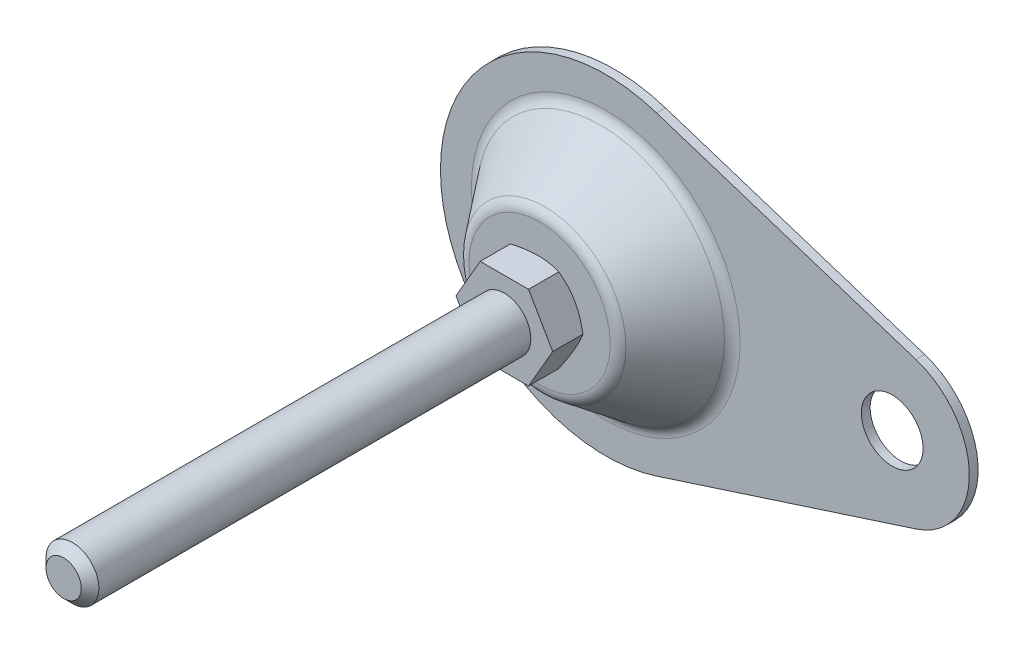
ISO-10303-21;
HEADER;
FILE_DESCRIPTION(('STEP AP214'),'2;1');
FILE_NAME('part.step','',(''),(''),'','','');
FILE_SCHEMA(('AUTOMOTIVE_DESIGN { 1 0 10303 214 1 1 1 1 }'));
ENDSEC;
DATA;
#1=APPLICATION_CONTEXT('core data for automotive mechanical design processes');
#2=APPLICATION_PROTOCOL_DEFINITION('international standard','automotive_design',2000,#1);
#3=PRODUCT_CONTEXT('',#1,'mechanical');
#4=PRODUCT('Part','Part','',(#3));
#5=PRODUCT_RELATED_PRODUCT_CATEGORY('part','',(#4));
#6=PRODUCT_DEFINITION_FORMATION('','',#4);
#7=PRODUCT_DEFINITION_CONTEXT('part definition',#1,'design');
#8=PRODUCT_DEFINITION('design','',#6,#7);
#9=PRODUCT_DEFINITION_SHAPE('','',#8);
#10=(LENGTH_UNIT() NAMED_UNIT(*) SI_UNIT(.MILLI.,.METRE.));
#11=(NAMED_UNIT(*) PLANE_ANGLE_UNIT() SI_UNIT($,.RADIAN.));
#12=(NAMED_UNIT(*) SI_UNIT($,.STERADIAN.) SOLID_ANGLE_UNIT());
#13=UNCERTAINTY_MEASURE_WITH_UNIT(LENGTH_MEASURE(1.E-05),#10,'distance_accuracy_value','');
#14=(GEOMETRIC_REPRESENTATION_CONTEXT(3) GLOBAL_UNCERTAINTY_ASSIGNED_CONTEXT((#13)) GLOBAL_UNIT_ASSIGNED_CONTEXT((#10,
#11,#12)) REPRESENTATION_CONTEXT('',''));
#15=CARTESIAN_POINT('',(0.,0.,0.));
#16=DIRECTION('',(0.,0.,1.));
#17=DIRECTION('',(1.,0.,0.));
#18=AXIS2_PLACEMENT_3D('',#15,#16,#17);
#19=CARTESIAN_POINT('',(65.,0.,2.));
#20=DIRECTION('',(0.,0.,1.));
#21=DIRECTION('',(1.,0.,0.));
#22=AXIS2_PLACEMENT_3D('',#19,#20,#21);
#23=PLANE('',#22);
#24=CARTESIAN_POINT('',(0.,0.,2.));
#25=DIRECTION('',(0.,0.,1.));
#26=DIRECTION('',(1.,0.,0.));
#27=AXIS2_PLACEMENT_3D('',#24,#25,#26);
#28=CIRCLE('',#27,30.4802116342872);
#29=CARTESIAN_POINT('',(30.4802116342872,0.,2.));
#30=VERTEX_POINT('',#29);
#31=EDGE_CURVE('E245',#30,#30,#28,.F.);
#32=ORIENTED_EDGE('',*,*,#31,.T.);
#33=EDGE_LOOP('',(#32));
#34=FACE_BOUND('',#33,.T.);
#35=CARTESIAN_POINT('',(65.,0.,2.));
#36=DIRECTION('',(0.,0.,1.));
#37=DIRECTION('',(1.,0.,0.));
#38=AXIS2_PLACEMENT_3D('',#35,#36,#37);
#39=CIRCLE('',#38,7.);
#40=CARTESIAN_POINT('',(72.,0.,2.));
#41=VERTEX_POINT('',#40);
#42=EDGE_CURVE('E262',#41,#41,#39,.T.);
#43=ORIENTED_EDGE('',*,*,#42,.F.);
#44=EDGE_LOOP('',(#43));
#45=FACE_BOUND('',#44,.T.);
#46=DIRECTION('',(-0.951485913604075,0.307692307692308,0.));
#47=VECTOR('',#46,1.);
#48=CARTESIAN_POINT('',(11.5384615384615,35.6807217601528,2.));
#49=LINE('',#48,#47);
#50=CARTESIAN_POINT('',(70.3846153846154,16.6510034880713,2.));
#51=VERTEX_POINT('',#50);
#52=CARTESIAN_POINT('',(11.5384615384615,35.6807217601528,2.));
#53=VERTEX_POINT('',#52);
#54=EDGE_CURVE('E112',#51,#53,#49,.T.);
#55=ORIENTED_EDGE('',*,*,#54,.T.);
#56=CARTESIAN_POINT('',(0.,0.,2.));
#57=DIRECTION('',(0.,0.,1.));
#58=DIRECTION('',(1.,0.,0.));
#59=AXIS2_PLACEMENT_3D('',#56,#57,#58);
#60=CIRCLE('',#59,37.5);
#61=CARTESIAN_POINT('',(11.5384615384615,-35.6807217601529,2.));
#62=VERTEX_POINT('',#61);
#63=EDGE_CURVE('E114',#53,#62,#60,.T.);
#64=ORIENTED_EDGE('',*,*,#63,.T.);
#65=DIRECTION('',(0.951485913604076,0.307692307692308,0.));
#66=VECTOR('',#65,1.);
#67=CARTESIAN_POINT('',(11.5384615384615,-35.6807217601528,2.));
#68=LINE('',#67,#66);
#69=CARTESIAN_POINT('',(70.3846153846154,-16.6510034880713,2.));
#70=VERTEX_POINT('',#69);
#71=EDGE_CURVE('E97',#62,#70,#68,.T.);
#72=ORIENTED_EDGE('',*,*,#71,.T.);
#73=CARTESIAN_POINT('',(65.,0.,2.));
#74=DIRECTION('',(0.,0.,1.));
#75=DIRECTION('',(1.,0.,0.));
#76=AXIS2_PLACEMENT_3D('',#73,#74,#75);
#77=CIRCLE('',#76,17.5);
#78=EDGE_CURVE('E106',#70,#51,#77,.T.);
#79=ORIENTED_EDGE('',*,*,#78,.T.);
#80=EDGE_LOOP('',(#55,#64,#72,#79));
#81=FACE_BOUND('',#80,.T.);
#82=ADVANCED_FACE('F14',(#34,#45,#81),#23,.T.);
#83=CARTESIAN_POINT('',(65.,0.,0.));
#84=DIRECTION('',(0.,0.,1.));
#85=DIRECTION('',(1.,0.,0.));
#86=AXIS2_PLACEMENT_3D('',#83,#84,#85);
#87=PLANE('',#86);
#88=CARTESIAN_POINT('',(65.,0.,0.));
#89=DIRECTION('',(0.,0.,1.));
#90=DIRECTION('',(1.,0.,0.));
#91=AXIS2_PLACEMENT_3D('',#88,#89,#90);
#92=CIRCLE('',#91,7.);
#93=CARTESIAN_POINT('',(72.,0.,0.));
#94=VERTEX_POINT('',#93);
#95=EDGE_CURVE('E258',#94,#94,#92,.T.);
#96=ORIENTED_EDGE('',*,*,#95,.T.);
#97=EDGE_LOOP('',(#96));
#98=FACE_BOUND('',#97,.T.);
#99=CARTESIAN_POINT('',(0.,0.,0.));
#100=DIRECTION('',(0.,0.,1.));
#101=DIRECTION('',(1.,0.,0.));
#102=AXIS2_PLACEMENT_3D('',#99,#100,#101);
#103=CIRCLE('',#102,37.5);
#104=CARTESIAN_POINT('',(11.5384615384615,35.6807217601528,0.));
#105=VERTEX_POINT('',#104);
#106=CARTESIAN_POINT('',(11.5384615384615,-35.6807217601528,0.));
#107=VERTEX_POINT('',#106);
#108=EDGE_CURVE('E275',#105,#107,#103,.T.);
#109=ORIENTED_EDGE('',*,*,#108,.F.);
#110=DIRECTION('',(-0.951485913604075,0.307692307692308,0.));
#111=VECTOR('',#110,1.);
#112=CARTESIAN_POINT('',(70.3846153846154,16.6510034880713,0.));
#113=LINE('',#112,#111);
#114=CARTESIAN_POINT('',(70.3846153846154,16.6510034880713,0.));
#115=VERTEX_POINT('',#114);
#116=EDGE_CURVE('E9',#115,#105,#113,.T.);
#117=ORIENTED_EDGE('',*,*,#116,.F.);
#118=CARTESIAN_POINT('',(65.,0.,0.));
#119=DIRECTION('',(0.,0.,1.));
#120=DIRECTION('',(1.,0.,0.));
#121=AXIS2_PLACEMENT_3D('',#118,#119,#120);
#122=CIRCLE('',#121,17.5);
#123=CARTESIAN_POINT('',(70.3846153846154,-16.6510034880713,0.));
#124=VERTEX_POINT('',#123);
#125=EDGE_CURVE('E22',#124,#115,#122,.T.);
#126=ORIENTED_EDGE('',*,*,#125,.F.);
#127=DIRECTION('',(0.951485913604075,0.307692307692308,0.));
#128=VECTOR('',#127,1.);
#129=CARTESIAN_POINT('',(70.3846153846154,-16.6510034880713,0.));
#130=LINE('',#129,#128);
#131=EDGE_CURVE('E99',#107,#124,#130,.T.);
#132=ORIENTED_EDGE('',*,*,#131,.F.);
#133=EDGE_LOOP('',(#109,#117,#126,#132));
#134=FACE_BOUND('',#133,.T.);
#135=ADVANCED_FACE('F215',(#98,#134),#87,.F.);
#136=CARTESIAN_POINT('',(0.,0.,17.));
#137=DIRECTION('',(0.,0.,-1.));
#138=DIRECTION('',(-1.,0.,0.));
#139=AXIS2_PLACEMENT_3D('',#136,#137,#138);
#140=PLANE('',#139);
#141=CARTESIAN_POINT('',(0.,0.,17.));
#142=DIRECTION('',(0.,0.,-1.));
#143=DIRECTION('',(-1.,0.,0.));
#144=AXIS2_PLACEMENT_3D('',#141,#142,#143);
#145=CIRCLE('',#144,16.0197883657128);
#146=CARTESIAN_POINT('',(-16.0197883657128,0.,17.));
#147=VERTEX_POINT('',#146);
#148=EDGE_CURVE('E278',#147,#147,#145,.F.);
#149=ORIENTED_EDGE('',*,*,#148,.T.);
#150=EDGE_LOOP('',(#149));
#151=FACE_BOUND('',#150,.T.);
#152=CARTESIAN_POINT('',(0.,0.,17.));
#153=DIRECTION('',(0.,0.,-1.));
#154=DIRECTION('',(-1.,0.,0.));
#155=AXIS2_PLACEMENT_3D('',#152,#153,#154);
#156=CIRCLE('',#155,9.);
#157=CARTESIAN_POINT('',(-9.,0.,17.));
#158=VERTEX_POINT('',#157);
#159=EDGE_CURVE('E122',#158,#158,#156,.T.);
#160=ORIENTED_EDGE('',*,*,#159,.T.);
#161=EDGE_LOOP('',(#160));
#162=FACE_BOUND('',#161,.T.);
#163=ADVANCED_FACE('F211',(#151,#162),#140,.F.);
#164=CARTESIAN_POINT('',(0.,0.,5.));
#165=DIRECTION('',(0.,0.,1.));
#166=DIRECTION('',(1.,0.,0.));
#167=AXIS2_PLACEMENT_3D('',#164,#165,#166);
#168=TOROIDAL_SURFACE('',#167,30.4802116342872,3.);
#169=CARTESIAN_POINT('',(0.,0.,3.1747053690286));
#170=DIRECTION('',(0.,0.,1.));
#171=DIRECTION('',(1.,0.,0.));
#172=AXIS2_PLACEMENT_3D('',#169,#170,#171);
#173=CIRCLE('',#172,28.0993925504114);
#174=CARTESIAN_POINT('',(28.0993925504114,0.,3.1747053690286));
#175=VERTEX_POINT('',#174);
#176=EDGE_CURVE('E242',#175,#175,#173,.T.);
#177=ORIENTED_EDGE('',*,*,#176,.F.);
#178=EDGE_LOOP('',(#177));
#179=FACE_BOUND('',#178,.T.);
#180=ORIENTED_EDGE('',*,*,#31,.F.);
#181=EDGE_LOOP('',(#180));
#182=FACE_BOUND('',#181,.T.);
#183=ADVANCED_FACE('F214',(#179,#182),#168,.F.);
#184=CARTESIAN_POINT('',(0.,0.,14.));
#185=DIRECTION('',(0.,0.,-1.));
#186=DIRECTION('',(-1.,0.,0.));
#187=AXIS2_PLACEMENT_3D('',#184,#185,#186);
#188=TOROIDAL_SURFACE('',#187,16.0197883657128,3.);
#189=ORIENTED_EDGE('',*,*,#148,.F.);
#190=EDGE_LOOP('',(#189));
#191=FACE_BOUND('',#190,.T.);
#192=CARTESIAN_POINT('',(0.,0.,15.8252946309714));
#193=DIRECTION('',(0.,0.,1.));
#194=DIRECTION('',(1.,0.,0.));
#195=AXIS2_PLACEMENT_3D('',#192,#193,#194);
#196=CIRCLE('',#195,18.4006074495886);
#197=CARTESIAN_POINT('',(18.4006074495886,0.,15.8252946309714));
#198=VERTEX_POINT('',#197);
#199=EDGE_CURVE('E251',#198,#198,#196,.F.);
#200=ORIENTED_EDGE('',*,*,#199,.F.);
#201=EDGE_LOOP('',(#200));
#202=FACE_BOUND('',#201,.T.);
#203=ADVANCED_FACE('F229',(#191,#202),#188,.T.);
#204=CARTESIAN_POINT('',(0.,0.,2.));
#205=DIRECTION('',(0.,0.,-1.));
#206=DIRECTION('',(-1.,0.,0.));
#207=AXIS2_PLACEMENT_3D('',#204,#205,#206);
#208=CYLINDRICAL_SURFACE('',#207,37.5);
#209=ORIENTED_EDGE('',*,*,#108,.T.);
#210=DIRECTION('',(0.,0.,1.));
#211=VECTOR('',#210,1.);
#212=CARTESIAN_POINT('',(11.5384615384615,-35.6807217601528,-8.));
#213=LINE('',#212,#211);
#214=EDGE_CURVE('E103',#107,#62,#213,.T.);
#215=ORIENTED_EDGE('',*,*,#214,.T.);
#216=ORIENTED_EDGE('',*,*,#63,.F.);
#217=DIRECTION('',(0.,0.,1.));
#218=VECTOR('',#217,1.);
#219=CARTESIAN_POINT('',(11.5384615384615,35.6807217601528,-8.));
#220=LINE('',#219,#218);
#221=EDGE_CURVE('E119',#105,#53,#220,.T.);
#222=ORIENTED_EDGE('',*,*,#221,.F.);
#223=EDGE_LOOP('',(#209,#215,#216,#222));
#224=FACE_BOUND('',#223,.T.);
#225=ADVANCED_FACE('F219',(#224),#208,.T.);
#226=CARTESIAN_POINT('',(65.,0.,2.));
#227=DIRECTION('',(0.,0.,-1.));
#228=DIRECTION('',(-1.,0.,0.));
#229=AXIS2_PLACEMENT_3D('',#226,#227,#228);
#230=CYLINDRICAL_SURFACE('',#229,7.);
#231=ORIENTED_EDGE('',*,*,#42,.T.);
#232=EDGE_LOOP('',(#231));
#233=FACE_BOUND('',#232,.T.);
#234=ORIENTED_EDGE('',*,*,#95,.F.);
#235=EDGE_LOOP('',(#234));
#236=FACE_BOUND('',#235,.T.);
#237=ADVANCED_FACE('F209',(#233,#236),#230,.F.);
#238=CARTESIAN_POINT('',(0.,0.,2.));
#239=DIRECTION('',(0.,0.,-1.));
#240=DIRECTION('',(-1.,0.,0.));
#241=AXIS2_PLACEMENT_3D('',#238,#239,#240);
#242=CONICAL_SURFACE('',#241,29.,0.654082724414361);
#243=ORIENTED_EDGE('',*,*,#176,.T.);
#244=EDGE_LOOP('',(#243));
#245=FACE_BOUND('',#244,.T.);
#246=ORIENTED_EDGE('',*,*,#199,.T.);
#247=EDGE_LOOP('',(#246));
#248=FACE_BOUND('',#247,.T.);
#249=ADVANCED_FACE('F151',(#245,#248),#242,.T.);
#250=CARTESIAN_POINT('',(0.,0.,17.));
#251=DIRECTION('',(0.,0.,1.));
#252=DIRECTION('',(1.,0.,0.));
#253=AXIS2_PLACEMENT_3D('',#250,#251,#252);
#254=CONICAL_SURFACE('',#253,9.,1.0471975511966);
#255=ORIENTED_EDGE('',*,*,#159,.F.);
#256=EDGE_LOOP('',(#255));
#257=FACE_BOUND('',#256,.T.);
#258=CARTESIAN_POINT('',(10.9697705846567,0.0002,18.137247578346));
#259=CARTESIAN_POINT('',(10.8492020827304,-0.208630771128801,18.0676485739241));
#260=CARTESIAN_POINT('',(10.7281840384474,-0.41824017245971,18.0012084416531));
#261=CARTESIAN_POINT('',(10.4851774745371,-0.839139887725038,17.8755224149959));
#262=CARTESIAN_POINT('',(10.3631886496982,-1.05043073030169,17.8162788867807));
#263=CARTESIAN_POINT('',(9.99525656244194,-1.68770779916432,17.6504897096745));
#264=CARTESIAN_POINT('',(9.74786083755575,-2.11620976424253,17.5561895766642));
#265=CARTESIAN_POINT('',(9.37764446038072,-2.75744333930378,17.4456138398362));
#266=CARTESIAN_POINT('',(9.2559298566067,-2.96825921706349,17.4141149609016));
#267=CARTESIAN_POINT('',(9.01193711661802,-3.39086703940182,17.3612933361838));
#268=CARTESIAN_POINT('',(8.88965896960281,-3.60265900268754,17.3399707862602));
#269=CARTESIAN_POINT('',(8.64489870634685,-4.02659621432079,17.3080481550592));
#270=CARTESIAN_POINT('',(8.52241700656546,-4.23874074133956,17.2974353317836));
#271=CARTESIAN_POINT('',(8.27734047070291,-4.66322575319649,17.2871576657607));
#272=CARTESIAN_POINT('',(8.15474563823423,-4.87556623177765,17.2874924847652));
#273=CARTESIAN_POINT('',(7.92555157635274,-5.27254199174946,17.2983485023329));
#274=CARTESIAN_POINT('',(7.81893617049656,-5.45720529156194,17.3075454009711));
#275=CARTESIAN_POINT('',(7.60595470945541,-5.82610000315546,17.3340405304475));
#276=CARTESIAN_POINT('',(7.49958867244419,-6.01033138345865,17.3513393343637));
#277=CARTESIAN_POINT('',(7.18090270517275,-6.56231167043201,17.414979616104));
#278=CARTESIAN_POINT('',(6.96914687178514,-6.92908353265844,17.4730570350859));
#279=CARTESIAN_POINT('',(6.5433889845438,-7.66651782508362,17.6182511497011));
#280=CARTESIAN_POINT('',(6.32944126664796,-8.03708614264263,17.7059833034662));
#281=CARTESIAN_POINT('',(5.90473630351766,-8.77269671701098,17.9050988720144));
#282=CARTESIAN_POINT('',(5.69397361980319,-9.137748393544,18.0164355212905));
#283=CARTESIAN_POINT('',(5.48471208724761,-9.5002,18.137247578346));
#284=B_SPLINE_CURVE_WITH_KNOTS('',3,(#258,#259,#260,#261,#262,#263,#264,#265,#266,#267,#268,
#269,#270,#271,#272,#273,#274,#275,#276,#277,#278,#279,#280,#281,#282,#283),.UNSPECIFIED.,.F.,
.F.,(4,2,2,2,2,2,2,2,2,2,2,2,4),(0.,0.752880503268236,1.50600787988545,3.0154687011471,
3.75167336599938,4.48789219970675,5.22323407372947,5.95855322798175,6.59868084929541,
7.23885375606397,8.52010929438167,9.82978009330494,11.1368800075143),.UNSPECIFIED.);
#285=CARTESIAN_POINT('',(10.9696551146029,0.,18.1371809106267));
#286=VERTEX_POINT('',#285);
#287=CARTESIAN_POINT('',(5.48482755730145,-9.5,18.1371809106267));
#288=VERTEX_POINT('',#287);
#289=EDGE_CURVE('E29',#286,#288,#284,.T.);
#290=ORIENTED_EDGE('',*,*,#289,.T.);
#291=CARTESIAN_POINT('',(-14.7429583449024,-9.5,21.9298013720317));
#292=CARTESIAN_POINT('',(-14.5354225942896,-9.5,21.8290822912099));
#293=CARTESIAN_POINT('',(-14.3276435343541,-9.5,21.7288647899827));
#294=CARTESIAN_POINT('',(-13.9115480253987,-9.5,21.5295465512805));
#295=CARTESIAN_POINT('',(-13.7032315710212,-9.5,21.4304458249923));
#296=CARTESIAN_POINT('',(-13.0773445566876,-9.5,21.1349631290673));
#297=CARTESIAN_POINT('',(-12.6588976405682,-9.5,20.9404304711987));
#298=CARTESIAN_POINT('',(-11.8169345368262,-9.5,20.5564267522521));
#299=CARTESIAN_POINT('',(-11.3934031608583,-9.5,20.3669889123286));
#300=CARTESIAN_POINT('',(-10.5429751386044,-9.5,19.9958516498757));
#301=CARTESIAN_POINT('',(-10.116078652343,-9.5,19.8141518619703));
#302=CARTESIAN_POINT('',(-9.24457729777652,-9.5,19.4549066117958));
#303=CARTESIAN_POINT('',(-8.79984130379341,-9.5,19.2776775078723));
#304=CARTESIAN_POINT('',(-7.90517155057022,-9.5,18.9366081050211));
#305=CARTESIAN_POINT('',(-7.45523721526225,-9.5,18.7727693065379));
#306=CARTESIAN_POINT('',(-6.55028756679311,-9.5,18.4627738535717));
#307=CARTESIAN_POINT('',(-6.09528460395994,-9.5,18.3165815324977));
#308=CARTESIAN_POINT('',(-5.17876919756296,-9.5,18.0465606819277));
#309=CARTESIAN_POINT('',(-4.71725884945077,-9.5,17.9227251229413));
#310=CARTESIAN_POINT('',(-3.78987247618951,-9.5,17.7040004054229));
#311=CARTESIAN_POINT('',(-3.32403341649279,-9.5,17.6089587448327));
#312=CARTESIAN_POINT('',(-2.62102556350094,-9.5,17.4921194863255));
#313=CARTESIAN_POINT('',(-2.38596467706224,-9.5,17.457458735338));
#314=CARTESIAN_POINT('',(-1.91467110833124,-9.5,17.3973911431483));
#315=CARTESIAN_POINT('',(-1.67843854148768,-9.5,17.3719834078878));
#316=CARTESIAN_POINT('',(-1.20821079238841,-9.5,17.3312474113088));
#317=CARTESIAN_POINT('',(-0.974226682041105,-9.5,17.3157918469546));
#318=CARTESIAN_POINT('',(-0.505814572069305,-9.5,17.294789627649));
#319=CARTESIAN_POINT('',(-0.271386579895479,-9.5,17.2892428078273));
#320=CARTESIAN_POINT('',(0.197496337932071,-9.5,17.2881904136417));
#321=CARTESIAN_POINT('',(0.431951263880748,-9.5,17.2926849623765));
#322=CARTESIAN_POINT('',(0.900462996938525,-9.5,17.3116055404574));
#323=CARTESIAN_POINT('',(1.13451978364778,-9.5,17.3260320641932));
#324=CARTESIAN_POINT('',(1.69659323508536,-9.5,17.372296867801));
#325=CARTESIAN_POINT('',(2.02423218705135,-9.5,17.4088230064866));
#326=CARTESIAN_POINT('',(2.67707070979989,-9.5,17.4993477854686));
#327=CARTESIAN_POINT('',(3.00226994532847,-9.5,17.5533487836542));
#328=CARTESIAN_POINT('',(3.97382957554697,-9.5,17.738699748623));
#329=CARTESIAN_POINT('',(4.61580035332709,-9.5,17.8933649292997));
#330=CARTESIAN_POINT('',(5.5759947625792,-9.5,18.1615399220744));
#331=CARTESIAN_POINT('',(5.89919518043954,-9.5,18.2582537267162));
#332=CARTESIAN_POINT('',(6.54245535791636,-9.5,18.4617088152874));
#333=CARTESIAN_POINT('',(6.86251509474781,-9.5,18.5684501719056));
#334=CARTESIAN_POINT('',(7.49959853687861,-9.5,18.7902486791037));
#335=CARTESIAN_POINT('',(7.81662318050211,-9.5,18.9053031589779));
#336=CARTESIAN_POINT('',(8.44804318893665,-9.5,19.1423755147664));
#337=CARTESIAN_POINT('',(8.76243860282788,-9.5,19.2643932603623));
#338=CARTESIAN_POINT('',(9.5756719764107,-9.5,19.5887146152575));
#339=CARTESIAN_POINT('',(10.0727160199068,-9.5,19.7955110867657));
#340=CARTESIAN_POINT('',(11.0620207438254,-9.5,20.2202826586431));
#341=CARTESIAN_POINT('',(11.5542809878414,-9.5,20.4382587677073));
#342=CARTESIAN_POINT('',(12.5350566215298,-9.5,20.882860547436));
#343=CARTESIAN_POINT('',(13.0235707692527,-9.5,21.1094889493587));
#344=CARTESIAN_POINT('',(13.9974170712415,-9.5,21.569421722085));
#345=CARTESIAN_POINT('',(14.4827493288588,-9.5,21.8027258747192));
#346=CARTESIAN_POINT('',(15.4515102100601,-9.5,22.2749464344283));
#347=CARTESIAN_POINT('',(15.9349352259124,-9.5,22.513870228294));
#348=CARTESIAN_POINT('',(16.899664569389,-9.5,22.9959629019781));
#349=CARTESIAN_POINT('',(17.3809688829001,-9.5,23.2391318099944));
#350=CARTESIAN_POINT('',(18.3417325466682,-9.5,23.7288672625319));
#351=CARTESIAN_POINT('',(18.8211922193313,-9.5,23.9754331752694));
#352=CARTESIAN_POINT('',(19.7786465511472,-9.5,24.4713947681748));
#353=CARTESIAN_POINT('',(20.2566412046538,-9.5,24.7207904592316));
#354=CARTESIAN_POINT('',(21.5947430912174,-9.5,25.4231216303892));
#355=CARTESIAN_POINT('',(22.4534701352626,-9.5,25.8786862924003));
#356=CARTESIAN_POINT('',(24.1679995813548,-9.5,26.7953779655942));
#357=CARTESIAN_POINT('',(25.0238018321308,-9.5,27.2565052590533));
#358=CARTESIAN_POINT('',(26.7305921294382,-9.5,28.1815595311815));
#359=CARTESIAN_POINT('',(27.5815869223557,-9.5,28.6454740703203));
#360=CARTESIAN_POINT('',(28.8567319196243,-9.5,29.3437348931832));
#361=CARTESIAN_POINT('',(29.2815414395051,-9.5,29.5768787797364));
#362=CARTESIAN_POINT('',(30.1307670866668,-9.5,30.0438806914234));
#363=CARTESIAN_POINT('',(30.5551832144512,-9.5,30.2777387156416));
#364=CARTESIAN_POINT('',(30.9794262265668,-9.5,30.5119104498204));
#365=B_SPLINE_CURVE_WITH_KNOTS('',3,(#291,#292,#293,#294,#295,#296,#297,#298,#299,#300,#301,
#302,#303,#304,#305,#306,#307,#308,#309,#310,#311,#312,#313,#314,#315,#316,#317,#318,#319,#320,
#321,#322,#323,#324,#325,#326,#327,#328,#329,#330,#331,#332,#333,#334,#335,#336,#337,#338,#339,
#340,#341,#342,#343,#344,#345,#346,#347,#348,#349,#350,#351,#352,#353,#354,#355,#356,#357,#358,
#359,#360,#361,#362,#363,#364),.UNSPECIFIED.,.F.,.F.,(4,2,2,2,2,2,2,2,2,2,2,2,2,2,2,2,2,2,2,2,2,
2,2,2,2,2,2,2,2,2,2,2,2,2,2,2,4),(0.,0.692052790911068,1.38411250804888,2.76843643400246,
4.16027741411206,5.55205260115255,6.98813128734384,8.42437067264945,9.85765675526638,
11.2904913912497,12.7155989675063,13.4282532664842,14.1408386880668,14.8441178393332,
15.5473852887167,16.2506613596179,16.9539724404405,17.9424205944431,18.9310021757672,
20.9092197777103,21.9212165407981,22.933220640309,23.9449010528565,24.9565625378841,
26.5714048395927,28.1863930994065,29.8018954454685,31.4173450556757,33.035052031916,
34.6527697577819,36.2701905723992,37.8876176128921,40.8038441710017,43.7202193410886,
46.6279029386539,48.0816468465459,49.5353888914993),.UNSPECIFIED.);
#366=CARTESIAN_POINT('',(-5.48482755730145,-9.5,18.1371809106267));
#367=VERTEX_POINT('',#366);
#368=EDGE_CURVE('E158',#288,#367,#365,.F.);
#369=ORIENTED_EDGE('',*,*,#368,.T.);
#370=CARTESIAN_POINT('',(-5.48471208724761,-9.5002,18.137247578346));
#371=CARTESIAN_POINT('',(-5.6052805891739,-9.2913692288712,18.0676485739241));
#372=CARTESIAN_POINT('',(-5.72629863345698,-9.0817598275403,18.0012084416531));
#373=CARTESIAN_POINT('',(-5.96930519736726,-8.66086011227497,17.8755224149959));
#374=CARTESIAN_POINT('',(-6.09129402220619,-8.44956926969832,17.8162788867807));
#375=CARTESIAN_POINT('',(-6.4592261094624,-7.81229220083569,17.6504897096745));
#376=CARTESIAN_POINT('',(-6.70662183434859,-7.38379023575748,17.5561895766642));
#377=CARTESIAN_POINT('',(-7.07683821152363,-6.74255666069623,17.4456138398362));
#378=CARTESIAN_POINT('',(-7.19855281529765,-6.53174078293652,17.4141149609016));
#379=CARTESIAN_POINT('',(-7.44254555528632,-6.10913296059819,17.3612933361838));
#380=CARTESIAN_POINT('',(-7.56482370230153,-5.89734099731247,17.3399707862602));
#381=CARTESIAN_POINT('',(-7.80958396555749,-5.47340378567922,17.3080481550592));
#382=CARTESIAN_POINT('',(-7.93206566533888,-5.26125925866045,17.2974353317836));
#383=CARTESIAN_POINT('',(-8.17714220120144,-4.83677424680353,17.2871576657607));
#384=CARTESIAN_POINT('',(-8.29973703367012,-4.62443376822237,17.2874924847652));
#385=CARTESIAN_POINT('',(-8.52893109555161,-4.22745800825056,17.2983485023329));
#386=CARTESIAN_POINT('',(-8.63554650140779,-4.04279470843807,17.3075454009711));
#387=CARTESIAN_POINT('',(-8.84852796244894,-3.67389999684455,17.3340405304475));
#388=CARTESIAN_POINT('',(-8.95489399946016,-3.48966861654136,17.3513393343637));
#389=CARTESIAN_POINT('',(-9.27357996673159,-2.937688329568,17.414979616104));
#390=CARTESIAN_POINT('',(-9.48533580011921,-2.57091646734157,17.473057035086));
#391=CARTESIAN_POINT('',(-9.91109368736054,-1.83348217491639,17.6182511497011));
#392=CARTESIAN_POINT('',(-10.1250414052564,-1.46291385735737,17.7059833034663));
#393=CARTESIAN_POINT('',(-10.5497463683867,-0.727303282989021,17.9050988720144));
#394=CARTESIAN_POINT('',(-10.7605090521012,-0.362251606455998,18.0164355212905));
#395=CARTESIAN_POINT('',(-10.9697705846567,0.00019999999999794,18.137247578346));
#396=B_SPLINE_CURVE_WITH_KNOTS('',3,(#370,#371,#372,#373,#374,#375,#376,#377,#378,#379,#380,
#381,#382,#383,#384,#385,#386,#387,#388,#389,#390,#391,#392,#393,#394,#395),.UNSPECIFIED.,.F.,
.F.,(4,2,2,2,2,2,2,2,2,2,2,2,4),(0.,0.752880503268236,1.50600787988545,3.0154687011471,
3.75167336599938,4.48789219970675,5.22323407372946,5.95855322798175,6.59868084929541,
7.23885375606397,8.52010929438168,9.82978009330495,11.1368800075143),.UNSPECIFIED.);
#397=CARTESIAN_POINT('',(-10.9696551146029,0.,18.1371809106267));
#398=VERTEX_POINT('',#397);
#399=EDGE_CURVE('E127',#367,#398,#396,.T.);
#400=ORIENTED_EDGE('',*,*,#399,.T.);
#401=CARTESIAN_POINT('',(-10.9697705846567,-0.000200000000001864,18.137247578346));
#402=CARTESIAN_POINT('',(-10.8492020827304,0.208630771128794,18.0676485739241));
#403=CARTESIAN_POINT('',(-10.7281840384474,0.418240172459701,18.0012084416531));
#404=CARTESIAN_POINT('',(-10.4851774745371,0.839139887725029,17.8755224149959));
#405=CARTESIAN_POINT('',(-10.3631886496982,1.05043073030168,17.8162788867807));
#406=CARTESIAN_POINT('',(-9.99525656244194,1.68770779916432,17.6504897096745));
#407=CARTESIAN_POINT('',(-9.74786083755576,2.11620976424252,17.5561895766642));
#408=CARTESIAN_POINT('',(-9.37764446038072,2.75744333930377,17.4456138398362));
#409=CARTESIAN_POINT('',(-9.2559298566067,2.96825921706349,17.4141149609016));
#410=CARTESIAN_POINT('',(-9.01193711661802,3.39086703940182,17.3612933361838));
#411=CARTESIAN_POINT('',(-8.88965896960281,3.60265900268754,17.3399707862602));
#412=CARTESIAN_POINT('',(-8.64489870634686,4.02659621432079,17.3080481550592));
#413=CARTESIAN_POINT('',(-8.52241700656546,4.23874074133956,17.2974353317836));
#414=CARTESIAN_POINT('',(-8.27734047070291,4.66322575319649,17.2871576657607));
#415=CARTESIAN_POINT('',(-8.15474563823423,4.87556623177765,17.2874924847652));
#416=CARTESIAN_POINT('',(-7.92555157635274,5.27254199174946,17.2983485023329));
#417=CARTESIAN_POINT('',(-7.81893617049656,5.45720529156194,17.3075454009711));
#418=CARTESIAN_POINT('',(-7.60595470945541,5.82610000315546,17.3340405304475));
#419=CARTESIAN_POINT('',(-7.49958867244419,6.01033138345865,17.3513393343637));
#420=CARTESIAN_POINT('',(-7.18090270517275,6.56231167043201,17.414979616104));
#421=CARTESIAN_POINT('',(-6.96914687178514,6.92908353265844,17.4730570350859));
#422=CARTESIAN_POINT('',(-6.5433889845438,7.66651782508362,17.6182511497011));
#423=CARTESIAN_POINT('',(-6.32944126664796,8.03708614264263,17.7059833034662));
#424=CARTESIAN_POINT('',(-5.90473630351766,8.77269671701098,17.9050988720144));
#425=CARTESIAN_POINT('',(-5.69397361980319,9.137748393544,18.0164355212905));
#426=CARTESIAN_POINT('',(-5.48471208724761,9.5002,18.137247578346));
#427=B_SPLINE_CURVE_WITH_KNOTS('',3,(#401,#402,#403,#404,#405,#406,#407,#408,#409,#410,#411,
#412,#413,#414,#415,#416,#417,#418,#419,#420,#421,#422,#423,#424,#425,#426),.UNSPECIFIED.,.F.,
.F.,(4,2,2,2,2,2,2,2,2,2,2,2,4),(0.,0.752880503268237,1.50600787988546,3.01546870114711,
3.75167336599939,4.48789219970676,5.22323407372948,5.95855322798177,6.59868084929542,
7.23885375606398,8.52010929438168,9.82978009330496,11.1368800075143),.UNSPECIFIED.);
#428=CARTESIAN_POINT('',(-5.48482755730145,9.5,18.1371809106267));
#429=VERTEX_POINT('',#428);
#430=EDGE_CURVE('E135',#398,#429,#427,.T.);
#431=ORIENTED_EDGE('',*,*,#430,.T.);
#432=CARTESIAN_POINT('',(-14.7429583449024,9.5,21.9298013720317));
#433=CARTESIAN_POINT('',(-14.5354225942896,9.5,21.8290822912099));
#434=CARTESIAN_POINT('',(-14.3276435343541,9.5,21.7288647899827));
#435=CARTESIAN_POINT('',(-13.9115480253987,9.5,21.5295465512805));
#436=CARTESIAN_POINT('',(-13.7032315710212,9.5,21.4304458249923));
#437=CARTESIAN_POINT('',(-13.0773445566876,9.5,21.1349631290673));
#438=CARTESIAN_POINT('',(-12.6588976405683,9.5,20.9404304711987));
#439=CARTESIAN_POINT('',(-11.8169345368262,9.5,20.5564267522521));
#440=CARTESIAN_POINT('',(-11.3934031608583,9.5,20.3669889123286));
#441=CARTESIAN_POINT('',(-10.5429751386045,9.5,19.9958516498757));
#442=CARTESIAN_POINT('',(-10.116078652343,9.5,19.8141518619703));
#443=CARTESIAN_POINT('',(-9.24457729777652,9.5,19.4549066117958));
#444=CARTESIAN_POINT('',(-8.79984130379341,9.5,19.2776775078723));
#445=CARTESIAN_POINT('',(-7.90517155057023,9.5,18.9366081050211));
#446=CARTESIAN_POINT('',(-7.45523721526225,9.5,18.7727693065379));
#447=CARTESIAN_POINT('',(-6.55028756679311,9.5,18.4627738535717));
#448=CARTESIAN_POINT('',(-6.09528460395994,9.5,18.3165815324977));
#449=CARTESIAN_POINT('',(-5.17876919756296,9.5,18.0465606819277));
#450=CARTESIAN_POINT('',(-4.71725884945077,9.5,17.9227251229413));
#451=CARTESIAN_POINT('',(-3.78987247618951,9.5,17.7040004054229));
#452=CARTESIAN_POINT('',(-3.32403341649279,9.5,17.6089587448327));
#453=CARTESIAN_POINT('',(-2.62102556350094,9.5,17.4921194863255));
#454=CARTESIAN_POINT('',(-2.38596467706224,9.5,17.457458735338));
#455=CARTESIAN_POINT('',(-1.91467110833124,9.5,17.3973911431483));
#456=CARTESIAN_POINT('',(-1.67843854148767,9.5,17.3719834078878));
#457=CARTESIAN_POINT('',(-1.20821079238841,9.5,17.3312474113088));
#458=CARTESIAN_POINT('',(-0.974226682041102,9.5,17.3157918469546));
#459=CARTESIAN_POINT('',(-0.505814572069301,9.5,17.294789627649));
#460=CARTESIAN_POINT('',(-0.271386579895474,9.5,17.2892428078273));
#461=CARTESIAN_POINT('',(0.197496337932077,9.5,17.2881904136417));
#462=CARTESIAN_POINT('',(0.431951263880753,9.5,17.2926849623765));
#463=CARTESIAN_POINT('',(0.90046299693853,9.5,17.3116055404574));
#464=CARTESIAN_POINT('',(1.13451978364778,9.5,17.3260320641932));
#465=CARTESIAN_POINT('',(1.69659323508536,9.5,17.372296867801));
#466=CARTESIAN_POINT('',(2.02423218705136,9.5,17.4088230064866));
#467=CARTESIAN_POINT('',(2.6770707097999,9.5,17.4993477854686));
#468=CARTESIAN_POINT('',(3.00226994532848,9.5,17.5533487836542));
#469=CARTESIAN_POINT('',(3.97382957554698,9.5,17.738699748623));
#470=CARTESIAN_POINT('',(4.61580035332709,9.5,17.8933649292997));
#471=CARTESIAN_POINT('',(5.57599476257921,9.5,18.1615399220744));
#472=CARTESIAN_POINT('',(5.89919518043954,9.5,18.2582537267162));
#473=CARTESIAN_POINT('',(6.54245535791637,9.5,18.4617088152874));
#474=CARTESIAN_POINT('',(6.86251509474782,9.5,18.5684501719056));
#475=CARTESIAN_POINT('',(7.49959853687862,9.5,18.7902486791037));
#476=CARTESIAN_POINT('',(7.81662318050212,9.5,18.9053031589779));
#477=CARTESIAN_POINT('',(8.44804318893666,9.5,19.1423755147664));
#478=CARTESIAN_POINT('',(8.76243860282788,9.5,19.2643932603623));
#479=CARTESIAN_POINT('',(9.57567197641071,9.5,19.5887146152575));
#480=CARTESIAN_POINT('',(10.0727160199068,9.5,19.7955110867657));
#481=CARTESIAN_POINT('',(11.0620207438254,9.5,20.2202826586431));
#482=CARTESIAN_POINT('',(11.5542809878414,9.5,20.4382587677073));
#483=CARTESIAN_POINT('',(12.5350566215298,9.5,20.882860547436));
#484=CARTESIAN_POINT('',(13.0235707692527,9.5,21.1094889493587));
#485=CARTESIAN_POINT('',(13.9974170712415,9.5,21.569421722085));
#486=CARTESIAN_POINT('',(14.4827493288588,9.5,21.8027258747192));
#487=CARTESIAN_POINT('',(15.4515102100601,9.5,22.2749464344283));
#488=CARTESIAN_POINT('',(15.9349352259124,9.5,22.513870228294));
#489=CARTESIAN_POINT('',(16.899664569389,9.5,22.9959629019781));
#490=CARTESIAN_POINT('',(17.3809688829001,9.5,23.2391318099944));
#491=CARTESIAN_POINT('',(18.3417325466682,9.5,23.7288672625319));
#492=CARTESIAN_POINT('',(18.8211922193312,9.5,23.9754331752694));
#493=CARTESIAN_POINT('',(19.7786465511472,9.5,24.4713947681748));
#494=CARTESIAN_POINT('',(20.2566412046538,9.5,24.7207904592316));
#495=CARTESIAN_POINT('',(21.5947430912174,9.5,25.4231216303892));
#496=CARTESIAN_POINT('',(22.4534701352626,9.5,25.8786862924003));
#497=CARTESIAN_POINT('',(24.1679995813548,9.5,26.7953779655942));
#498=CARTESIAN_POINT('',(25.0238018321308,9.5,27.2565052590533));
#499=CARTESIAN_POINT('',(26.7305921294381,9.5,28.1815595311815));
#500=CARTESIAN_POINT('',(27.5815869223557,9.5,28.6454740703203));
#501=CARTESIAN_POINT('',(28.8567319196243,9.5,29.3437348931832));
#502=CARTESIAN_POINT('',(29.2815414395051,9.5,29.5768787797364));
#503=CARTESIAN_POINT('',(30.1307670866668,9.5,30.0438806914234));
#504=CARTESIAN_POINT('',(30.5551832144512,9.5,30.2777387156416));
#505=CARTESIAN_POINT('',(30.9794262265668,9.5,30.5119104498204));
#506=B_SPLINE_CURVE_WITH_KNOTS('',3,(#432,#433,#434,#435,#436,#437,#438,#439,#440,#441,#442,
#443,#444,#445,#446,#447,#448,#449,#450,#451,#452,#453,#454,#455,#456,#457,#458,#459,#460,#461,
#462,#463,#464,#465,#466,#467,#468,#469,#470,#471,#472,#473,#474,#475,#476,#477,#478,#479,#480,
#481,#482,#483,#484,#485,#486,#487,#488,#489,#490,#491,#492,#493,#494,#495,#496,#497,#498,#499,
#500,#501,#502,#503,#504,#505),.UNSPECIFIED.,.F.,.F.,(4,2,2,2,2,2,2,2,2,2,2,2,2,2,2,2,2,2,2,2,2,
2,2,2,2,2,2,2,2,2,2,2,2,2,2,2,4),(0.,0.692052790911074,1.38411250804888,2.76843643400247,
4.16027741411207,5.55205260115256,6.98813128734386,8.42437067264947,9.8576567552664,
11.2904913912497,12.7155989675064,13.4282532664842,14.1408386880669,14.8441178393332,
15.5473852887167,16.250661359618,16.9539724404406,17.9424205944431,18.9310021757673,
20.9092197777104,21.9212165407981,22.933220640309,23.9449010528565,24.9565625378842,
26.5714048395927,28.1863930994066,29.8018954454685,31.4173450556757,33.0350520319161,
34.6527697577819,36.2701905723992,37.8876176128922,40.8038441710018,43.7202193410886,
46.6279029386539,48.081646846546,49.5353888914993),.UNSPECIFIED.);
#507=CARTESIAN_POINT('',(5.48482755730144,9.5,18.1371809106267));
#508=VERTEX_POINT('',#507);
#509=EDGE_CURVE('E169',#429,#508,#506,.T.);
#510=ORIENTED_EDGE('',*,*,#509,.T.);
#511=CARTESIAN_POINT('',(5.48471208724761,9.5002,18.137247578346));
#512=CARTESIAN_POINT('',(5.6052805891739,9.2913692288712,18.0676485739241));
#513=CARTESIAN_POINT('',(5.72629863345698,9.0817598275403,18.0012084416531));
#514=CARTESIAN_POINT('',(5.96930519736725,8.66086011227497,17.8755224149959));
#515=CARTESIAN_POINT('',(6.09129402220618,8.44956926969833,17.8162788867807));
#516=CARTESIAN_POINT('',(6.4592261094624,7.81229220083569,17.6504897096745));
#517=CARTESIAN_POINT('',(6.70662183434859,7.38379023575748,17.5561895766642));
#518=CARTESIAN_POINT('',(7.07683821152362,6.74255666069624,17.4456138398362));
#519=CARTESIAN_POINT('',(7.19855281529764,6.53174078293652,17.4141149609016));
#520=CARTESIAN_POINT('',(7.44254555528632,6.10913296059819,17.3612933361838));
#521=CARTESIAN_POINT('',(7.56482370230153,5.89734099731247,17.3399707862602));
#522=CARTESIAN_POINT('',(7.80958396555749,5.47340378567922,17.3080481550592));
#523=CARTESIAN_POINT('',(7.93206566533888,5.26125925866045,17.2974353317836));
#524=CARTESIAN_POINT('',(8.17714220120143,4.83677424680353,17.2871576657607));
#525=CARTESIAN_POINT('',(8.29973703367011,4.62443376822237,17.2874924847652));
#526=CARTESIAN_POINT('',(8.5289310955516,4.22745800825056,17.2983485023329));
#527=CARTESIAN_POINT('',(8.63554650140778,4.04279470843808,17.3075454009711));
#528=CARTESIAN_POINT('',(8.84852796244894,3.67389999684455,17.3340405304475));
#529=CARTESIAN_POINT('',(8.95489399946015,3.48966861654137,17.3513393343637));
#530=CARTESIAN_POINT('',(9.27357996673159,2.93768832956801,17.414979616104));
#531=CARTESIAN_POINT('',(9.4853358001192,2.57091646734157,17.473057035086));
#532=CARTESIAN_POINT('',(9.91109368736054,1.8334821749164,17.6182511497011));
#533=CARTESIAN_POINT('',(10.1250414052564,1.46291385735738,17.7059833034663));
#534=CARTESIAN_POINT('',(10.5497463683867,0.727303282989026,17.9050988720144));
#535=CARTESIAN_POINT('',(10.7605090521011,0.362251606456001,18.0164355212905));
#536=CARTESIAN_POINT('',(10.9697705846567,-0.000199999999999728,18.137247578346));
#537=B_SPLINE_CURVE_WITH_KNOTS('',3,(#511,#512,#513,#514,#515,#516,#517,#518,#519,#520,#521,
#522,#523,#524,#525,#526,#527,#528,#529,#530,#531,#532,#533,#534,#535,#536),.UNSPECIFIED.,.F.,
.F.,(4,2,2,2,2,2,2,2,2,2,2,2,4),(0.,0.752880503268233,1.50600787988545,3.0154687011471,
3.75167336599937,4.48789219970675,5.22323407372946,5.95855322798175,6.5986808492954,
7.23885375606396,8.52010929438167,9.82978009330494,11.1368800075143),.UNSPECIFIED.);
#538=EDGE_CURVE('E176',#508,#286,#537,.T.);
#539=ORIENTED_EDGE('',*,*,#538,.T.);
#540=EDGE_LOOP('',(#290,#369,#400,#431,#510,#539));
#541=FACE_BOUND('',#540,.T.);
#542=ADVANCED_FACE('F145',(#257,#541),#254,.T.);
#543=CARTESIAN_POINT('',(0.,0.,125.));
#544=DIRECTION('',(0.,0.,1.));
#545=DIRECTION('',(1.,0.,0.));
#546=AXIS2_PLACEMENT_3D('',#543,#544,#545);
#547=PLANE('',#546);
#548=CARTESIAN_POINT('',(0.,0.,125.));
#549=DIRECTION('',(0.,0.,1.));
#550=DIRECTION('',(1.,0.,0.));
#551=AXIS2_PLACEMENT_3D('',#548,#549,#550);
#552=CIRCLE('',#551,4.);
#553=CARTESIAN_POINT('',(4.,0.,125.));
#554=VERTEX_POINT('',#553);
#555=EDGE_CURVE('E246',#554,#554,#552,.T.);
#556=ORIENTED_EDGE('',*,*,#555,.T.);
#557=EDGE_LOOP('',(#556));
#558=FACE_BOUND('',#557,.T.);
#559=ADVANCED_FACE('F150',(#558),#547,.T.);
#560=CARTESIAN_POINT('',(0.,0.,125.));
#561=DIRECTION('',(0.,0.,-1.));
#562=DIRECTION('',(-1.,0.,0.));
#563=AXIS2_PLACEMENT_3D('',#560,#561,#562);
#564=CONICAL_SURFACE('',#563,4.,0.785398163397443);
#565=CARTESIAN_POINT('',(0.,0.,123.));
#566=DIRECTION('',(0.,0.,1.));
#567=DIRECTION('',(1.,0.,0.));
#568=AXIS2_PLACEMENT_3D('',#565,#566,#567);
#569=CIRCLE('',#568,6.);
#570=CARTESIAN_POINT('',(6.,0.,123.));
#571=VERTEX_POINT('',#570);
#572=EDGE_CURVE('E249',#571,#571,#569,.F.);
#573=ORIENTED_EDGE('',*,*,#572,.F.);
#574=EDGE_LOOP('',(#573));
#575=FACE_BOUND('',#574,.T.);
#576=ORIENTED_EDGE('',*,*,#555,.F.);
#577=EDGE_LOOP('',(#576));
#578=FACE_BOUND('',#577,.T.);
#579=ADVANCED_FACE('F16',(#575,#578),#564,.T.);
#580=CARTESIAN_POINT('',(0.,0.,125.));
#581=DIRECTION('',(0.,0.,-1.));
#582=DIRECTION('',(-1.,0.,0.));
#583=AXIS2_PLACEMENT_3D('',#580,#581,#582);
#584=CYLINDRICAL_SURFACE('',#583,6.);
#585=CARTESIAN_POINT('',(0.,0.,25.));
#586=DIRECTION('',(0.,0.,1.));
#587=DIRECTION('',(1.,0.,0.));
#588=AXIS2_PLACEMENT_3D('',#585,#586,#587);
#589=CIRCLE('',#588,6.);
#590=CARTESIAN_POINT('',(6.,0.,25.));
#591=VERTEX_POINT('',#590);
#592=EDGE_CURVE('E256',#591,#591,#589,.T.);
#593=ORIENTED_EDGE('',*,*,#592,.T.);
#594=EDGE_LOOP('',(#593));
#595=FACE_BOUND('',#594,.T.);
#596=ORIENTED_EDGE('',*,*,#572,.T.);
#597=EDGE_LOOP('',(#596));
#598=FACE_BOUND('',#597,.T.);
#599=ADVANCED_FACE('F203',(#595,#598),#584,.T.);
#600=CARTESIAN_POINT('',(0.,0.,25.));
#601=DIRECTION('',(0.,0.,1.));
#602=DIRECTION('',(1.,0.,0.));
#603=AXIS2_PLACEMENT_3D('',#600,#601,#602);
#604=PLANE('',#603);
#605=DIRECTION('',(0.5,0.866025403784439,0.));
#606=VECTOR('',#605,1.);
#607=CARTESIAN_POINT('',(5.48482755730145,-9.5,25.));
#608=LINE('',#607,#606);
#609=CARTESIAN_POINT('',(5.48482755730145,-9.5,25.));
#610=VERTEX_POINT('',#609);
#611=CARTESIAN_POINT('',(10.9696551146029,0.,25.));
#612=VERTEX_POINT('',#611);
#613=EDGE_CURVE('E321',#610,#612,#608,.T.);
#614=ORIENTED_EDGE('',*,*,#613,.T.);
#615=DIRECTION('',(-0.5,0.866025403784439,0.));
#616=VECTOR('',#615,1.);
#617=CARTESIAN_POINT('',(10.9696551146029,0.,25.));
#618=LINE('',#617,#616);
#619=CARTESIAN_POINT('',(5.48482755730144,9.5,25.));
#620=VERTEX_POINT('',#619);
#621=EDGE_CURVE('E320',#612,#620,#618,.T.);
#622=ORIENTED_EDGE('',*,*,#621,.T.);
#623=DIRECTION('',(-1.,0.,0.));
#624=VECTOR('',#623,1.);
#625=CARTESIAN_POINT('',(5.48482755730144,9.5,25.));
#626=LINE('',#625,#624);
#627=CARTESIAN_POINT('',(-5.48482755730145,9.5,25.));
#628=VERTEX_POINT('',#627);
#629=EDGE_CURVE('E318',#620,#628,#626,.T.);
#630=ORIENTED_EDGE('',*,*,#629,.T.);
#631=DIRECTION('',(-0.5,-0.866025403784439,0.));
#632=VECTOR('',#631,1.);
#633=CARTESIAN_POINT('',(-5.48482755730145,9.5,25.));
#634=LINE('',#633,#632);
#635=CARTESIAN_POINT('',(-10.9696551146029,0.,25.));
#636=VERTEX_POINT('',#635);
#637=EDGE_CURVE('E314',#628,#636,#634,.T.);
#638=ORIENTED_EDGE('',*,*,#637,.T.);
#639=DIRECTION('',(0.5,-0.866025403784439,0.));
#640=VECTOR('',#639,1.);
#641=CARTESIAN_POINT('',(-10.9696551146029,0.,25.));
#642=LINE('',#641,#640);
#643=CARTESIAN_POINT('',(-5.48482755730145,-9.5,25.));
#644=VERTEX_POINT('',#643);
#645=EDGE_CURVE('E328',#636,#644,#642,.T.);
#646=ORIENTED_EDGE('',*,*,#645,.T.);
#647=DIRECTION('',(1.,0.,0.));
#648=VECTOR('',#647,1.);
#649=CARTESIAN_POINT('',(-5.48482755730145,-9.5,25.));
#650=LINE('',#649,#648);
#651=EDGE_CURVE('E37',#644,#610,#650,.T.);
#652=ORIENTED_EDGE('',*,*,#651,.T.);
#653=EDGE_LOOP('',(#614,#622,#630,#638,#646,#652));
#654=FACE_BOUND('',#653,.T.);
#655=ORIENTED_EDGE('',*,*,#592,.F.);
#656=EDGE_LOOP('',(#655));
#657=FACE_BOUND('',#656,.T.);
#658=ADVANCED_FACE('F154',(#654,#657),#604,.T.);
#659=CARTESIAN_POINT('',(-5.48482755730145,-9.5,25.));
#660=DIRECTION('',(0.,1.,0.));
#661=DIRECTION('',(0.,0.,1.));
#662=AXIS2_PLACEMENT_3D('',#659,#660,#661);
#663=PLANE('',#662);
#664=ORIENTED_EDGE('',*,*,#368,.F.);
#665=DIRECTION('',(0.,0.,-1.));
#666=VECTOR('',#665,1.);
#667=CARTESIAN_POINT('',(5.48482755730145,-9.5,25.));
#668=LINE('',#667,#666);
#669=EDGE_CURVE('E304',#610,#288,#668,.T.);
#670=ORIENTED_EDGE('',*,*,#669,.F.);
#671=ORIENTED_EDGE('',*,*,#651,.F.);
#672=DIRECTION('',(0.,0.,-1.));
#673=VECTOR('',#672,1.);
#674=CARTESIAN_POINT('',(-5.48482755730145,-9.5,25.));
#675=LINE('',#674,#673);
#676=EDGE_CURVE('E300',#644,#367,#675,.T.);
#677=ORIENTED_EDGE('',*,*,#676,.T.);
#678=EDGE_LOOP('',(#664,#670,#671,#677));
#679=FACE_BOUND('',#678,.T.);
#680=ADVANCED_FACE('F303',(#679),#663,.F.);
#681=CARTESIAN_POINT('',(-10.9696551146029,0.,25.));
#682=DIRECTION('',(0.866025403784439,0.5,0.));
#683=DIRECTION('',(-0.5,0.866025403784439,0.));
#684=AXIS2_PLACEMENT_3D('',#681,#682,#683);
#685=PLANE('',#684);
#686=ORIENTED_EDGE('',*,*,#399,.F.);
#687=ORIENTED_EDGE('',*,*,#676,.F.);
#688=ORIENTED_EDGE('',*,*,#645,.F.);
#689=DIRECTION('',(0.,0.,-1.));
#690=VECTOR('',#689,1.);
#691=CARTESIAN_POINT('',(-10.9696551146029,0.,25.));
#692=LINE('',#691,#690);
#693=EDGE_CURVE('E302',#636,#398,#692,.T.);
#694=ORIENTED_EDGE('',*,*,#693,.T.);
#695=EDGE_LOOP('',(#686,#687,#688,#694));
#696=FACE_BOUND('',#695,.T.);
#697=ADVANCED_FACE('F142',(#696),#685,.F.);
#698=CARTESIAN_POINT('',(-5.48482755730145,9.5,25.));
#699=DIRECTION('',(0.866025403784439,-0.5,0.));
#700=DIRECTION('',(0.5,0.866025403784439,0.));
#701=AXIS2_PLACEMENT_3D('',#698,#699,#700);
#702=PLANE('',#701);
#703=ORIENTED_EDGE('',*,*,#430,.F.);
#704=ORIENTED_EDGE('',*,*,#693,.F.);
#705=ORIENTED_EDGE('',*,*,#637,.F.);
#706=DIRECTION('',(0.,0.,-1.));
#707=VECTOR('',#706,1.);
#708=CARTESIAN_POINT('',(-5.48482755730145,9.5,25.));
#709=LINE('',#708,#707);
#710=EDGE_CURVE('E270',#628,#429,#709,.T.);
#711=ORIENTED_EDGE('',*,*,#710,.T.);
#712=EDGE_LOOP('',(#703,#704,#705,#711));
#713=FACE_BOUND('',#712,.T.);
#714=ADVANCED_FACE('F313',(#713),#702,.F.);
#715=CARTESIAN_POINT('',(5.48482755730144,9.5,25.));
#716=DIRECTION('',(0.,-1.,0.));
#717=DIRECTION('',(1.,0.,0.));
#718=AXIS2_PLACEMENT_3D('',#715,#716,#717);
#719=PLANE('',#718);
#720=ORIENTED_EDGE('',*,*,#509,.F.);
#721=ORIENTED_EDGE('',*,*,#710,.F.);
#722=ORIENTED_EDGE('',*,*,#629,.F.);
#723=DIRECTION('',(0.,0.,-1.));
#724=VECTOR('',#723,1.);
#725=CARTESIAN_POINT('',(5.48482755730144,9.5,25.));
#726=LINE('',#725,#724);
#727=EDGE_CURVE('E265',#620,#508,#726,.T.);
#728=ORIENTED_EDGE('',*,*,#727,.T.);
#729=EDGE_LOOP('',(#720,#721,#722,#728));
#730=FACE_BOUND('',#729,.T.);
#731=ADVANCED_FACE('F192',(#730),#719,.F.);
#732=CARTESIAN_POINT('',(10.9696551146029,0.,25.));
#733=DIRECTION('',(-0.866025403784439,-0.5,0.));
#734=DIRECTION('',(0.5,-0.866025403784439,0.));
#735=AXIS2_PLACEMENT_3D('',#732,#733,#734);
#736=PLANE('',#735);
#737=ORIENTED_EDGE('',*,*,#538,.F.);
#738=ORIENTED_EDGE('',*,*,#727,.F.);
#739=ORIENTED_EDGE('',*,*,#621,.F.);
#740=DIRECTION('',(0.,0.,-1.));
#741=VECTOR('',#740,1.);
#742=CARTESIAN_POINT('',(10.9696551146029,0.,25.));
#743=LINE('',#742,#741);
#744=EDGE_CURVE('E259',#612,#286,#743,.T.);
#745=ORIENTED_EDGE('',*,*,#744,.T.);
#746=EDGE_LOOP('',(#737,#738,#739,#745));
#747=FACE_BOUND('',#746,.T.);
#748=ADVANCED_FACE('F188',(#747),#736,.F.);
#749=CARTESIAN_POINT('',(5.48482755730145,-9.5,25.));
#750=DIRECTION('',(-0.866025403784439,0.5,0.));
#751=DIRECTION('',(-0.5,-0.866025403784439,0.));
#752=AXIS2_PLACEMENT_3D('',#749,#750,#751);
#753=PLANE('',#752);
#754=ORIENTED_EDGE('',*,*,#289,.F.);
#755=ORIENTED_EDGE('',*,*,#744,.F.);
#756=ORIENTED_EDGE('',*,*,#613,.F.);
#757=ORIENTED_EDGE('',*,*,#669,.T.);
#758=EDGE_LOOP('',(#754,#755,#756,#757));
#759=FACE_BOUND('',#758,.T.);
#760=ADVANCED_FACE('F191',(#759),#753,.F.);
#761=CARTESIAN_POINT('',(11.5384615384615,35.6807217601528,-8.));
#762=DIRECTION('',(0.307692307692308,0.951485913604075,0.));
#763=DIRECTION('',(-0.951485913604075,0.307692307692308,0.));
#764=AXIS2_PLACEMENT_3D('',#761,#762,#763);
#765=PLANE('',#764);
#766=ORIENTED_EDGE('',*,*,#116,.T.);
#767=ORIENTED_EDGE('',*,*,#221,.T.);
#768=ORIENTED_EDGE('',*,*,#54,.F.);
#769=DIRECTION('',(0.,0.,1.));
#770=VECTOR('',#769,1.);
#771=CARTESIAN_POINT('',(70.3846153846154,16.6510034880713,-8.));
#772=LINE('',#771,#770);
#773=EDGE_CURVE('E102',#115,#51,#772,.T.);
#774=ORIENTED_EDGE('',*,*,#773,.F.);
#775=EDGE_LOOP('',(#766,#767,#768,#774));
#776=FACE_BOUND('',#775,.T.);
#777=ADVANCED_FACE('F198',(#776),#765,.T.);
#778=CARTESIAN_POINT('',(65.,0.,-8.));
#779=DIRECTION('',(0.,0.,1.));
#780=DIRECTION('',(1.,0.,0.));
#781=AXIS2_PLACEMENT_3D('',#778,#779,#780);
#782=CYLINDRICAL_SURFACE('',#781,17.5);
#783=ORIENTED_EDGE('',*,*,#125,.T.);
#784=ORIENTED_EDGE('',*,*,#773,.T.);
#785=ORIENTED_EDGE('',*,*,#78,.F.);
#786=DIRECTION('',(0.,0.,1.));
#787=VECTOR('',#786,1.);
#788=CARTESIAN_POINT('',(70.3846153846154,-16.6510034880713,-8.));
#789=LINE('',#788,#787);
#790=EDGE_CURVE('E92',#124,#70,#789,.T.);
#791=ORIENTED_EDGE('',*,*,#790,.F.);
#792=EDGE_LOOP('',(#783,#784,#785,#791));
#793=FACE_BOUND('',#792,.T.);
#794=ADVANCED_FACE('F107',(#793),#782,.T.);
#795=CARTESIAN_POINT('',(11.5384615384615,-35.6807217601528,-8.));
#796=DIRECTION('',(0.307692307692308,-0.951485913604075,0.));
#797=DIRECTION('',(0.951485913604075,0.307692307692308,0.));
#798=AXIS2_PLACEMENT_3D('',#795,#796,#797);
#799=PLANE('',#798);
#800=ORIENTED_EDGE('',*,*,#131,.T.);
#801=ORIENTED_EDGE('',*,*,#790,.T.);
#802=ORIENTED_EDGE('',*,*,#71,.F.);
#803=ORIENTED_EDGE('',*,*,#214,.F.);
#804=EDGE_LOOP('',(#800,#801,#802,#803));
#805=FACE_BOUND('',#804,.T.);
#806=ADVANCED_FACE('F94',(#805),#799,.T.);
#807=CLOSED_SHELL('',(#82,#135,#163,#183,#203,#225,#237,#249,#542,#559,#579,#599,#658,#680,#697,
#714,#731,#748,#760,#777,#794,#806));
#808=MANIFOLD_SOLID_BREP('B1',#807);
#809=ADVANCED_BREP_SHAPE_REPRESENTATION('',(#18,#808),#14);
#810=SHAPE_DEFINITION_REPRESENTATION(#9,#809);
ENDSEC;
END-ISO-10303-21;
